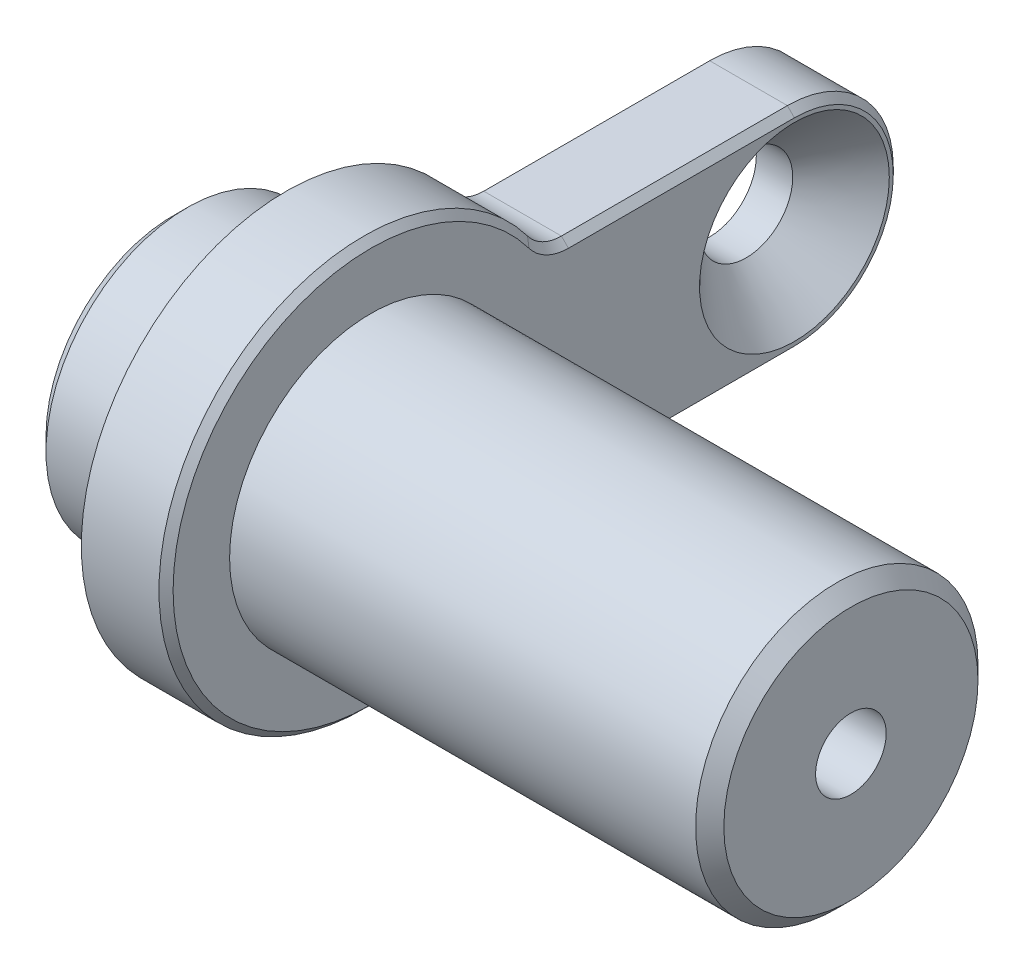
from build123d import *

# Parameters (mm, degrees)
BOSS_EXTRUDE1_DEPTH                                  = 40
BOSS_EXTRUDE1_DEPTH_BACK                             = 8
SKETCH1_R                                            = 10
BOSS_EXTRUDE2_DEPTH                                  = 6
CSK_FOR_M6_HEX_SOCKET_COUNTERSUNK_CAP_SC_D           = 6.6
CSK_FOR_M6_HEX_SOCKET_COUNTERSUNK_CAP_SC_CSINK_D     = 13.44
CSK_FOR_M6_HEX_SOCKET_COUNTERSUNK_CAP_SC_CSINK_ANGLE = 90
FILLET1_R                                            = 3
CHAMFER1_SIZE                                        = 1
CHAMFER2_SIZE                                        = 0.5
CHAMFER3_SIZE                                        = 1
M6_TAPPED_HOLE1_D                                    = 5
M6_TAPPED_HOLE1_DEPTH                                = 17
M6_TAPPED_HOLE1_TIP                                  = 1.502151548
M8_TAPPED_HOLE1_D                                    = 6.8
M8_TAPPED_HOLE1_DEPTH                                = 22.25
M8_TAPPED_HOLE1_TIP                                  = 2.042926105


with BuildPart() as part:
    # Sketch1 → Boss-Extrude1 (new, two sides: drawn at the far end of the back side and taken through both)
    with BuildSketch(Plane(origin=(0, 0, 0), x_dir=(0, -1, 0), z_dir=(1, 0, 0)).offset(-BOSS_EXTRUDE1_DEPTH_BACK)):
        with Locations(Location((0, 0, 0), (0, 0, 90))):
            Circle(SKETCH1_R)
    extrude(amount=BOSS_EXTRUDE1_DEPTH + BOSS_EXTRUDE1_DEPTH_BACK)

    # Sketch3 → Boss-Extrude2 (add)
    with BuildSketch(Plane(origin=(0, 0, 0), x_dir=(0, 0, -1), z_dir=(1, 0, 0))):
        with BuildLine():
            Line((12.409673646, 7.5), (30, 7.5))
            ThreePointArc((30, 7.5), (37.5, 0), (30, -7.5))
            Line((30, -7.5), (12.409673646, -7.5))
            ThreePointArc((12.409673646, -7.5), (-14.5, 0), (12.409673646, 7.5))
        make_face()
    extrude(amount=BOSS_EXTRUDE2_DEPTH)

    # CSK for M6 Hex Socket Countersunk Cap Sc (through all)
    with Locations(Plane(origin=(6, 0, 0), x_dir=(0, 0, -1), z_dir=(1, 0, 0))):
        with Locations((30, 0)):
            CounterSinkHole(CSK_FOR_M6_HEX_SOCKET_COUNTERSUNK_CAP_SC_D / 2, CSK_FOR_M6_HEX_SOCKET_COUNTERSUNK_CAP_SC_CSINK_D / 2, counter_sink_angle=CSK_FOR_M6_HEX_SOCKET_COUNTERSUNK_CAP_SC_CSINK_ANGLE)

    # Fillet1
    fillet1_edges = [part.edges().sort_by_distance(p)[0] for p in [
        (3, 7.5, -12.409673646),
        (3, -7.5, -12.409673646),
    ]]
    fillet(fillet1_edges, radius=FILLET1_R)

    # Chamfer1
    chamfer1_edges = [part.edges().sort_by_distance(p)[0] for p in [
        (-8, 0, 10),
    ]]
    chamfer(chamfer1_edges, length=CHAMFER1_SIZE)

    # Chamfer2
    chamfer2_edges = [part.edges().sort_by_distance(p)[0] for p in [
        (6, 0, -37.5),
        (6, 7.5, -22),
        (6, 0, 14.5),
        (6, -7.5, -22),
        (6, 7.816718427, -12.658359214),
        (6, -7.816718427, -12.658359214),
    ]]
    chamfer(chamfer2_edges, length=CHAMFER2_SIZE)

    # Chamfer3
    chamfer3_edges = [part.edges().sort_by_distance(p)[0] for p in [
        (40, 0, 10),
    ]]
    chamfer(chamfer3_edges, length=CHAMFER3_SIZE)

    # M6 Tapped Hole1
    with Locations(Plane(origin=(40, 0, 0), x_dir=(0, 0, -1), z_dir=(1, 0, 0))):
        with Locations((0, 0)):
            Hole(M6_TAPPED_HOLE1_D / 2, depth=M6_TAPPED_HOLE1_DEPTH)
            with Locations((0, 0, -(M6_TAPPED_HOLE1_DEPTH + M6_TAPPED_HOLE1_TIP / 2))):  # 118° drill point
                Cone(0, M6_TAPPED_HOLE1_D / 2, M6_TAPPED_HOLE1_TIP, mode=Mode.SUBTRACT)

    # M8 Tapped Hole1
    with Locations(Plane.ZY.offset(8)):
        with Locations((0, 0)):
            Hole(M8_TAPPED_HOLE1_D / 2, depth=M8_TAPPED_HOLE1_DEPTH)
            with Locations((0, 0, -(M8_TAPPED_HOLE1_DEPTH + M8_TAPPED_HOLE1_TIP / 2))):  # 118° drill point
                Cone(0, M8_TAPPED_HOLE1_D / 2, M8_TAPPED_HOLE1_TIP, mode=Mode.SUBTRACT)


solid = part.part
